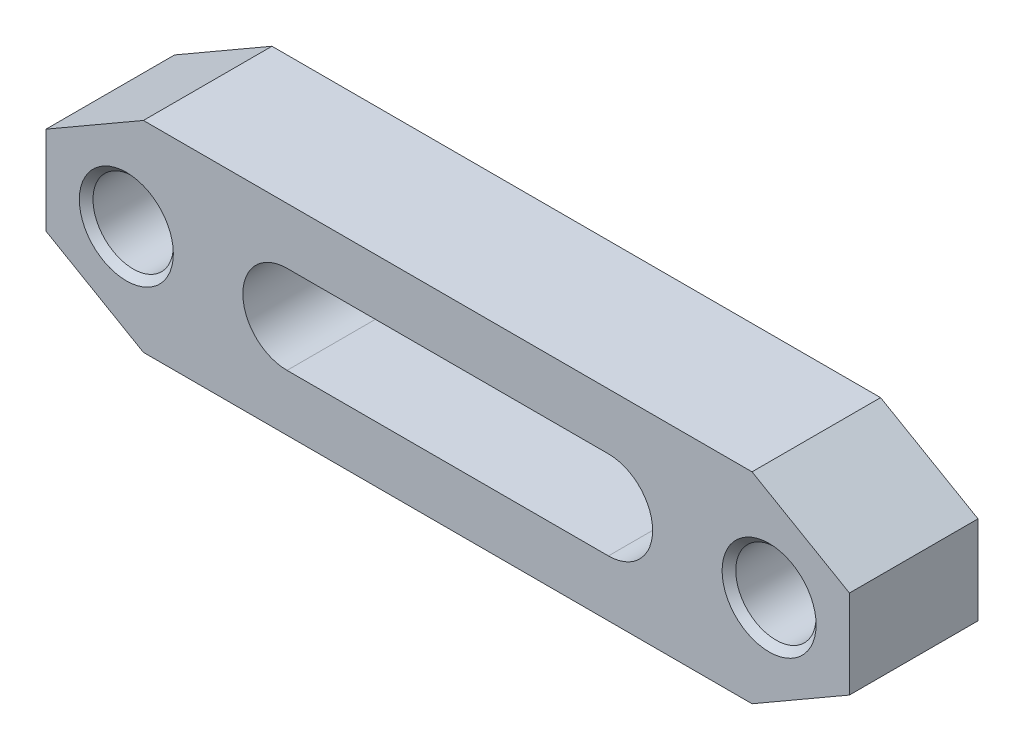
ISO-10303-21;
HEADER;
FILE_DESCRIPTION(('STEP AP214'),'2;1');
FILE_NAME('part.step','',(''),(''),'','','');
FILE_SCHEMA(('AUTOMOTIVE_DESIGN { 1 0 10303 214 1 1 1 1 }'));
ENDSEC;
DATA;
#1=APPLICATION_CONTEXT('core data for automotive mechanical design processes');
#2=APPLICATION_PROTOCOL_DEFINITION('international standard','automotive_design',2000,#1);
#3=PRODUCT_CONTEXT('',#1,'mechanical');
#4=PRODUCT('Part','Part','',(#3));
#5=PRODUCT_RELATED_PRODUCT_CATEGORY('part','',(#4));
#6=PRODUCT_DEFINITION_FORMATION('','',#4);
#7=PRODUCT_DEFINITION_CONTEXT('part definition',#1,'design');
#8=PRODUCT_DEFINITION('design','',#6,#7);
#9=PRODUCT_DEFINITION_SHAPE('','',#8);
#10=(LENGTH_UNIT() NAMED_UNIT(*) SI_UNIT(.MILLI.,.METRE.));
#11=(NAMED_UNIT(*) PLANE_ANGLE_UNIT() SI_UNIT($,.RADIAN.));
#12=(NAMED_UNIT(*) SI_UNIT($,.STERADIAN.) SOLID_ANGLE_UNIT());
#13=UNCERTAINTY_MEASURE_WITH_UNIT(LENGTH_MEASURE(1.E-05),#10,'distance_accuracy_value','');
#14=(GEOMETRIC_REPRESENTATION_CONTEXT(3) GLOBAL_UNCERTAINTY_ASSIGNED_CONTEXT((#13)) GLOBAL_UNIT_ASSIGNED_CONTEXT((#10,
#11,#12)) REPRESENTATION_CONTEXT('',''));
#15=CARTESIAN_POINT('',(0.,0.,0.));
#16=DIRECTION('',(0.,0.,1.));
#17=DIRECTION('',(1.,0.,0.));
#18=AXIS2_PLACEMENT_3D('',#15,#16,#17);
#19=CARTESIAN_POINT('',(50.,-12.5,16.));
#20=DIRECTION('',(0.,0.,1.));
#21=DIRECTION('',(1.,0.,0.));
#22=AXIS2_PLACEMENT_3D('',#19,#20,#21);
#23=PLANE('',#22);
#24=CARTESIAN_POINT('',(40.,0.,16.));
#25=DIRECTION('',(0.,0.,-1.));
#26=DIRECTION('',(-1.,0.,0.));
#27=AXIS2_PLACEMENT_3D('',#24,#25,#26);
#28=CIRCLE('',#27,5.85);
#29=CARTESIAN_POINT('',(34.15,0.,16.));
#30=VERTEX_POINT('',#29);
#31=EDGE_CURVE('E212',#30,#30,#28,.T.);
#32=ORIENTED_EDGE('',*,*,#31,.T.);
#33=EDGE_LOOP('',(#32));
#34=FACE_BOUND('',#33,.T.);
#35=CARTESIAN_POINT('',(-40.,0.,16.));
#36=DIRECTION('',(0.,0.,-1.));
#37=DIRECTION('',(-1.,0.,0.));
#38=AXIS2_PLACEMENT_3D('',#35,#36,#37);
#39=CIRCLE('',#38,5.85);
#40=CARTESIAN_POINT('',(-45.85,0.,16.));
#41=VERTEX_POINT('',#40);
#42=EDGE_CURVE('E133',#41,#41,#39,.T.);
#43=ORIENTED_EDGE('',*,*,#42,.T.);
#44=EDGE_LOOP('',(#43));
#45=FACE_BOUND('',#44,.T.);
#46=DIRECTION('',(1.,0.,0.));
#47=VECTOR('',#46,1.);
#48=CARTESIAN_POINT('',(-37.8756443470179,-12.5,16.));
#49=LINE('',#48,#47);
#50=CARTESIAN_POINT('',(-37.8756443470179,-12.5,16.));
#51=VERTEX_POINT('',#50);
#52=CARTESIAN_POINT('',(37.8756443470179,-12.5,16.));
#53=VERTEX_POINT('',#52);
#54=EDGE_CURVE('E143',#51,#53,#49,.T.);
#55=ORIENTED_EDGE('',*,*,#54,.T.);
#56=DIRECTION('',(0.866025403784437,0.5,0.));
#57=VECTOR('',#56,1.);
#58=CARTESIAN_POINT('',(37.8756443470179,-12.5,16.));
#59=LINE('',#58,#57);
#60=CARTESIAN_POINT('',(50.,-5.5,16.));
#61=VERTEX_POINT('',#60);
#62=EDGE_CURVE('E146',#53,#61,#59,.T.);
#63=ORIENTED_EDGE('',*,*,#62,.T.);
#64=DIRECTION('',(0.,1.,0.));
#65=VECTOR('',#64,1.);
#66=CARTESIAN_POINT('',(50.,-5.5,16.));
#67=LINE('',#66,#65);
#68=CARTESIAN_POINT('',(50.,5.5,16.));
#69=VERTEX_POINT('',#68);
#70=EDGE_CURVE('E149',#61,#69,#67,.T.);
#71=ORIENTED_EDGE('',*,*,#70,.T.);
#72=DIRECTION('',(-0.866025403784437,0.5,0.));
#73=VECTOR('',#72,1.);
#74=CARTESIAN_POINT('',(37.8756443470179,12.5,16.));
#75=LINE('',#74,#73);
#76=CARTESIAN_POINT('',(37.8756443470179,12.5,16.));
#77=VERTEX_POINT('',#76);
#78=EDGE_CURVE('E151',#69,#77,#75,.T.);
#79=ORIENTED_EDGE('',*,*,#78,.T.);
#80=DIRECTION('',(-1.,0.,0.));
#81=VECTOR('',#80,1.);
#82=CARTESIAN_POINT('',(-37.8756443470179,12.5,16.));
#83=LINE('',#82,#81);
#84=CARTESIAN_POINT('',(-37.8756443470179,12.5,16.));
#85=VERTEX_POINT('',#84);
#86=EDGE_CURVE('E153',#77,#85,#83,.T.);
#87=ORIENTED_EDGE('',*,*,#86,.T.);
#88=DIRECTION('',(-0.866025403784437,-0.5,0.));
#89=VECTOR('',#88,1.);
#90=CARTESIAN_POINT('',(-37.8756443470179,12.5,16.));
#91=LINE('',#90,#89);
#92=CARTESIAN_POINT('',(-50.,5.5,16.));
#93=VERTEX_POINT('',#92);
#94=EDGE_CURVE('E155',#85,#93,#91,.T.);
#95=ORIENTED_EDGE('',*,*,#94,.T.);
#96=DIRECTION('',(0.,-1.,0.));
#97=VECTOR('',#96,1.);
#98=CARTESIAN_POINT('',(-50.,-5.5,16.));
#99=LINE('',#98,#97);
#100=CARTESIAN_POINT('',(-50.,-5.5,16.));
#101=VERTEX_POINT('',#100);
#102=EDGE_CURVE('E157',#93,#101,#99,.T.);
#103=ORIENTED_EDGE('',*,*,#102,.T.);
#104=DIRECTION('',(0.866025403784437,-0.5,0.));
#105=VECTOR('',#104,1.);
#106=CARTESIAN_POINT('',(-37.8756443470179,-12.5,16.));
#107=LINE('',#106,#105);
#108=EDGE_CURVE('E159',#101,#51,#107,.T.);
#109=ORIENTED_EDGE('',*,*,#108,.T.);
#110=EDGE_LOOP('',(#55,#63,#71,#79,#87,#95,#103,#109));
#111=FACE_BOUND('',#110,.T.);
#112=DIRECTION('',(-1.,0.,0.));
#113=VECTOR('',#112,1.);
#114=CARTESIAN_POINT('',(20.,5.5,16.));
#115=LINE('',#114,#113);
#116=CARTESIAN_POINT('',(20.,5.5,16.));
#117=VERTEX_POINT('',#116);
#118=CARTESIAN_POINT('',(-20.,5.5,16.));
#119=VERTEX_POINT('',#118);
#120=EDGE_CURVE('E113',#117,#119,#115,.T.);
#121=ORIENTED_EDGE('',*,*,#120,.F.);
#122=CARTESIAN_POINT('',(20.,0.,16.));
#123=DIRECTION('',(0.,0.,1.));
#124=DIRECTION('',(1.,0.,0.));
#125=AXIS2_PLACEMENT_3D('',#122,#123,#124);
#126=CIRCLE('',#125,5.5);
#127=CARTESIAN_POINT('',(20.,-5.5,16.));
#128=VERTEX_POINT('',#127);
#129=EDGE_CURVE('E105',#128,#117,#126,.T.);
#130=ORIENTED_EDGE('',*,*,#129,.F.);
#131=DIRECTION('',(1.,0.,0.));
#132=VECTOR('',#131,1.);
#133=CARTESIAN_POINT('',(20.,-5.5,16.));
#134=LINE('',#133,#132);
#135=CARTESIAN_POINT('',(-20.,-5.5,16.));
#136=VERTEX_POINT('',#135);
#137=EDGE_CURVE('E127',#136,#128,#134,.T.);
#138=ORIENTED_EDGE('',*,*,#137,.F.);
#139=CARTESIAN_POINT('',(-20.,0.,16.));
#140=DIRECTION('',(0.,0.,1.));
#141=DIRECTION('',(1.,0.,0.));
#142=AXIS2_PLACEMENT_3D('',#139,#140,#141);
#143=CIRCLE('',#142,5.5);
#144=EDGE_CURVE('E125',#119,#136,#143,.T.);
#145=ORIENTED_EDGE('',*,*,#144,.F.);
#146=EDGE_LOOP('',(#121,#130,#138,#145));
#147=FACE_BOUND('',#146,.T.);
#148=ADVANCED_FACE('F14',(#34,#45,#111,#147),#23,.T.);
#149=CARTESIAN_POINT('',(50.,-12.5,0.));
#150=DIRECTION('',(0.,0.,1.));
#151=DIRECTION('',(1.,0.,0.));
#152=AXIS2_PLACEMENT_3D('',#149,#150,#151);
#153=PLANE('',#152);
#154=CARTESIAN_POINT('',(40.,0.,0.));
#155=DIRECTION('',(0.,0.,-1.));
#156=DIRECTION('',(-1.,0.,0.));
#157=AXIS2_PLACEMENT_3D('',#154,#155,#156);
#158=CIRCLE('',#157,5.85);
#159=CARTESIAN_POINT('',(34.15,0.,0.));
#160=VERTEX_POINT('',#159);
#161=EDGE_CURVE('E202',#160,#160,#158,.T.);
#162=ORIENTED_EDGE('',*,*,#161,.F.);
#163=EDGE_LOOP('',(#162));
#164=FACE_BOUND('',#163,.T.);
#165=CARTESIAN_POINT('',(-40.,0.,0.));
#166=DIRECTION('',(0.,0.,-1.));
#167=DIRECTION('',(-1.,0.,0.));
#168=AXIS2_PLACEMENT_3D('',#165,#166,#167);
#169=CIRCLE('',#168,5.85);
#170=CARTESIAN_POINT('',(-45.85,0.,0.));
#171=VERTEX_POINT('',#170);
#172=EDGE_CURVE('E215',#171,#171,#169,.T.);
#173=ORIENTED_EDGE('',*,*,#172,.F.);
#174=EDGE_LOOP('',(#173));
#175=FACE_BOUND('',#174,.T.);
#176=DIRECTION('',(1.,0.,0.));
#177=VECTOR('',#176,1.);
#178=CARTESIAN_POINT('',(-37.8756443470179,-12.5,0.));
#179=LINE('',#178,#177);
#180=CARTESIAN_POINT('',(-37.8756443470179,-12.5,0.));
#181=VERTEX_POINT('',#180);
#182=CARTESIAN_POINT('',(37.8756443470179,-12.5,0.));
#183=VERTEX_POINT('',#182);
#184=EDGE_CURVE('E121',#181,#183,#179,.T.);
#185=ORIENTED_EDGE('',*,*,#184,.F.);
#186=DIRECTION('',(0.866025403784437,-0.5,0.));
#187=VECTOR('',#186,1.);
#188=CARTESIAN_POINT('',(-37.8756443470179,-12.5,0.));
#189=LINE('',#188,#187);
#190=CARTESIAN_POINT('',(-50.,-5.5,0.));
#191=VERTEX_POINT('',#190);
#192=EDGE_CURVE('E147',#191,#181,#189,.T.);
#193=ORIENTED_EDGE('',*,*,#192,.F.);
#194=DIRECTION('',(0.,-1.,0.));
#195=VECTOR('',#194,1.);
#196=CARTESIAN_POINT('',(-50.,-5.5,0.));
#197=LINE('',#196,#195);
#198=CARTESIAN_POINT('',(-50.,5.5,0.));
#199=VERTEX_POINT('',#198);
#200=EDGE_CURVE('E174',#199,#191,#197,.T.);
#201=ORIENTED_EDGE('',*,*,#200,.F.);
#202=DIRECTION('',(-0.866025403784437,-0.5,0.));
#203=VECTOR('',#202,1.);
#204=CARTESIAN_POINT('',(-37.8756443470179,12.5,0.));
#205=LINE('',#204,#203);
#206=CARTESIAN_POINT('',(-37.8756443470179,12.5,0.));
#207=VERTEX_POINT('',#206);
#208=EDGE_CURVE('E172',#207,#199,#205,.T.);
#209=ORIENTED_EDGE('',*,*,#208,.F.);
#210=DIRECTION('',(-1.,0.,0.));
#211=VECTOR('',#210,1.);
#212=CARTESIAN_POINT('',(-37.8756443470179,12.5,0.));
#213=LINE('',#212,#211);
#214=CARTESIAN_POINT('',(37.8756443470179,12.5,0.));
#215=VERTEX_POINT('',#214);
#216=EDGE_CURVE('E170',#215,#207,#213,.T.);
#217=ORIENTED_EDGE('',*,*,#216,.F.);
#218=DIRECTION('',(-0.866025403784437,0.5,0.));
#219=VECTOR('',#218,1.);
#220=CARTESIAN_POINT('',(37.8756443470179,12.5,0.));
#221=LINE('',#220,#219);
#222=CARTESIAN_POINT('',(50.,5.5,0.));
#223=VERTEX_POINT('',#222);
#224=EDGE_CURVE('E168',#223,#215,#221,.T.);
#225=ORIENTED_EDGE('',*,*,#224,.F.);
#226=DIRECTION('',(0.,1.,0.));
#227=VECTOR('',#226,1.);
#228=CARTESIAN_POINT('',(50.,-5.5,0.));
#229=LINE('',#228,#227);
#230=CARTESIAN_POINT('',(50.,-5.5,0.));
#231=VERTEX_POINT('',#230);
#232=EDGE_CURVE('E166',#231,#223,#229,.T.);
#233=ORIENTED_EDGE('',*,*,#232,.F.);
#234=DIRECTION('',(0.866025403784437,0.5,0.));
#235=VECTOR('',#234,1.);
#236=CARTESIAN_POINT('',(37.8756443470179,-12.5,0.));
#237=LINE('',#236,#235);
#238=EDGE_CURVE('E164',#183,#231,#237,.T.);
#239=ORIENTED_EDGE('',*,*,#238,.F.);
#240=EDGE_LOOP('',(#185,#193,#201,#209,#217,#225,#233,#239));
#241=FACE_BOUND('',#240,.T.);
#242=CARTESIAN_POINT('',(20.,0.,0.));
#243=DIRECTION('',(0.,0.,1.));
#244=DIRECTION('',(1.,0.,0.));
#245=AXIS2_PLACEMENT_3D('',#242,#243,#244);
#246=CIRCLE('',#245,5.5);
#247=CARTESIAN_POINT('',(20.,-5.5,0.));
#248=VERTEX_POINT('',#247);
#249=CARTESIAN_POINT('',(20.,5.5,0.));
#250=VERTEX_POINT('',#249);
#251=EDGE_CURVE('E39',#248,#250,#246,.T.);
#252=ORIENTED_EDGE('',*,*,#251,.T.);
#253=DIRECTION('',(-1.,0.,0.));
#254=VECTOR('',#253,1.);
#255=CARTESIAN_POINT('',(20.,5.5,0.));
#256=LINE('',#255,#254);
#257=CARTESIAN_POINT('',(-20.,5.5,0.));
#258=VERTEX_POINT('',#257);
#259=EDGE_CURVE('E120',#250,#258,#256,.T.);
#260=ORIENTED_EDGE('',*,*,#259,.T.);
#261=CARTESIAN_POINT('',(-20.,0.,0.));
#262=DIRECTION('',(0.,0.,1.));
#263=DIRECTION('',(1.,0.,0.));
#264=AXIS2_PLACEMENT_3D('',#261,#262,#263);
#265=CIRCLE('',#264,5.5);
#266=CARTESIAN_POINT('',(-20.,-5.5,0.));
#267=VERTEX_POINT('',#266);
#268=EDGE_CURVE('E135',#258,#267,#265,.T.);
#269=ORIENTED_EDGE('',*,*,#268,.T.);
#270=DIRECTION('',(1.,0.,0.));
#271=VECTOR('',#270,1.);
#272=CARTESIAN_POINT('',(20.,-5.5,0.));
#273=LINE('',#272,#271);
#274=EDGE_CURVE('E114',#267,#248,#273,.T.);
#275=ORIENTED_EDGE('',*,*,#274,.T.);
#276=EDGE_LOOP('',(#252,#260,#269,#275));
#277=FACE_BOUND('',#276,.T.);
#278=ADVANCED_FACE('F238',(#164,#175,#241,#277),#153,.F.);
#279=CARTESIAN_POINT('',(-37.8756443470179,-12.5,16.));
#280=DIRECTION('',(0.,1.,0.));
#281=DIRECTION('',(-1.,0.,0.));
#282=AXIS2_PLACEMENT_3D('',#279,#280,#281);
#283=PLANE('',#282);
#284=ORIENTED_EDGE('',*,*,#184,.T.);
#285=DIRECTION('',(0.,0.,-1.));
#286=VECTOR('',#285,1.);
#287=CARTESIAN_POINT('',(37.8756443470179,-12.5,16.));
#288=LINE('',#287,#286);
#289=EDGE_CURVE('E9',#53,#183,#288,.T.);
#290=ORIENTED_EDGE('',*,*,#289,.F.);
#291=ORIENTED_EDGE('',*,*,#54,.F.);
#292=DIRECTION('',(0.,0.,-1.));
#293=VECTOR('',#292,1.);
#294=CARTESIAN_POINT('',(-37.8756443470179,-12.5,16.));
#295=LINE('',#294,#293);
#296=EDGE_CURVE('E161',#51,#181,#295,.T.);
#297=ORIENTED_EDGE('',*,*,#296,.T.);
#298=EDGE_LOOP('',(#284,#290,#291,#297));
#299=FACE_BOUND('',#298,.T.);
#300=ADVANCED_FACE('F16',(#299),#283,.F.);
#301=CARTESIAN_POINT('',(37.8756443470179,-12.5,16.));
#302=DIRECTION('',(-0.5,0.866025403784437,0.));
#303=DIRECTION('',(-0.866025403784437,-0.5,0.));
#304=AXIS2_PLACEMENT_3D('',#301,#302,#303);
#305=PLANE('',#304);
#306=ORIENTED_EDGE('',*,*,#238,.T.);
#307=DIRECTION('',(0.,0.,-1.));
#308=VECTOR('',#307,1.);
#309=CARTESIAN_POINT('',(50.,-5.5,16.));
#310=LINE('',#309,#308);
#311=EDGE_CURVE('E23',#61,#231,#310,.T.);
#312=ORIENTED_EDGE('',*,*,#311,.F.);
#313=ORIENTED_EDGE('',*,*,#62,.F.);
#314=ORIENTED_EDGE('',*,*,#289,.T.);
#315=EDGE_LOOP('',(#306,#312,#313,#314));
#316=FACE_BOUND('',#315,.T.);
#317=ADVANCED_FACE('F271',(#316),#305,.F.);
#318=CARTESIAN_POINT('',(50.,-5.5,16.));
#319=DIRECTION('',(-1.,0.,0.));
#320=DIRECTION('',(0.,0.,1.));
#321=AXIS2_PLACEMENT_3D('',#318,#319,#320);
#322=PLANE('',#321);
#323=ORIENTED_EDGE('',*,*,#232,.T.);
#324=DIRECTION('',(0.,0.,-1.));
#325=VECTOR('',#324,1.);
#326=CARTESIAN_POINT('',(50.,5.5,16.));
#327=LINE('',#326,#325);
#328=EDGE_CURVE('E191',#69,#223,#327,.T.);
#329=ORIENTED_EDGE('',*,*,#328,.F.);
#330=ORIENTED_EDGE('',*,*,#70,.F.);
#331=ORIENTED_EDGE('',*,*,#311,.T.);
#332=EDGE_LOOP('',(#323,#329,#330,#331));
#333=FACE_BOUND('',#332,.T.);
#334=ADVANCED_FACE('F268',(#333),#322,.F.);
#335=CARTESIAN_POINT('',(37.8756443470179,12.5,16.));
#336=DIRECTION('',(-0.5,-0.866025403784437,0.));
#337=DIRECTION('',(0.866025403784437,-0.5,0.));
#338=AXIS2_PLACEMENT_3D('',#335,#336,#337);
#339=PLANE('',#338);
#340=ORIENTED_EDGE('',*,*,#224,.T.);
#341=DIRECTION('',(0.,0.,-1.));
#342=VECTOR('',#341,1.);
#343=CARTESIAN_POINT('',(37.8756443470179,12.5,16.));
#344=LINE('',#343,#342);
#345=EDGE_CURVE('E188',#77,#215,#344,.T.);
#346=ORIENTED_EDGE('',*,*,#345,.F.);
#347=ORIENTED_EDGE('',*,*,#78,.F.);
#348=ORIENTED_EDGE('',*,*,#328,.T.);
#349=EDGE_LOOP('',(#340,#346,#347,#348));
#350=FACE_BOUND('',#349,.T.);
#351=ADVANCED_FACE('F264',(#350),#339,.F.);
#352=CARTESIAN_POINT('',(-37.8756443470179,12.5,16.));
#353=DIRECTION('',(0.,-1.,0.));
#354=DIRECTION('',(0.,0.,-1.));
#355=AXIS2_PLACEMENT_3D('',#352,#353,#354);
#356=PLANE('',#355);
#357=ORIENTED_EDGE('',*,*,#216,.T.);
#358=DIRECTION('',(0.,0.,-1.));
#359=VECTOR('',#358,1.);
#360=CARTESIAN_POINT('',(-37.8756443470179,12.5,16.));
#361=LINE('',#360,#359);
#362=EDGE_CURVE('E185',#85,#207,#361,.T.);
#363=ORIENTED_EDGE('',*,*,#362,.F.);
#364=ORIENTED_EDGE('',*,*,#86,.F.);
#365=ORIENTED_EDGE('',*,*,#345,.T.);
#366=EDGE_LOOP('',(#357,#363,#364,#365));
#367=FACE_BOUND('',#366,.T.);
#368=ADVANCED_FACE('F260',(#367),#356,.F.);
#369=CARTESIAN_POINT('',(-37.8756443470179,12.5,16.));
#370=DIRECTION('',(0.5,-0.866025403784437,0.));
#371=DIRECTION('',(0.866025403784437,0.5,0.));
#372=AXIS2_PLACEMENT_3D('',#369,#370,#371);
#373=PLANE('',#372);
#374=ORIENTED_EDGE('',*,*,#208,.T.);
#375=DIRECTION('',(0.,0.,-1.));
#376=VECTOR('',#375,1.);
#377=CARTESIAN_POINT('',(-50.,5.5,16.));
#378=LINE('',#377,#376);
#379=EDGE_CURVE('E182',#93,#199,#378,.T.);
#380=ORIENTED_EDGE('',*,*,#379,.F.);
#381=ORIENTED_EDGE('',*,*,#94,.F.);
#382=ORIENTED_EDGE('',*,*,#362,.T.);
#383=EDGE_LOOP('',(#374,#380,#381,#382));
#384=FACE_BOUND('',#383,.T.);
#385=ADVANCED_FACE('F256',(#384),#373,.F.);
#386=CARTESIAN_POINT('',(-50.,-5.5,16.));
#387=DIRECTION('',(1.,0.,0.));
#388=DIRECTION('',(0.,0.,-1.));
#389=AXIS2_PLACEMENT_3D('',#386,#387,#388);
#390=PLANE('',#389);
#391=ORIENTED_EDGE('',*,*,#200,.T.);
#392=DIRECTION('',(0.,0.,-1.));
#393=VECTOR('',#392,1.);
#394=CARTESIAN_POINT('',(-50.,-5.5,16.));
#395=LINE('',#394,#393);
#396=EDGE_CURVE('E179',#101,#191,#395,.T.);
#397=ORIENTED_EDGE('',*,*,#396,.F.);
#398=ORIENTED_EDGE('',*,*,#102,.F.);
#399=ORIENTED_EDGE('',*,*,#379,.T.);
#400=EDGE_LOOP('',(#391,#397,#398,#399));
#401=FACE_BOUND('',#400,.T.);
#402=ADVANCED_FACE('F252',(#401),#390,.F.);
#403=CARTESIAN_POINT('',(-37.8756443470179,-12.5,16.));
#404=DIRECTION('',(0.5,0.866025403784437,0.));
#405=DIRECTION('',(-0.866025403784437,0.5,0.));
#406=AXIS2_PLACEMENT_3D('',#403,#404,#405);
#407=PLANE('',#406);
#408=ORIENTED_EDGE('',*,*,#192,.T.);
#409=ORIENTED_EDGE('',*,*,#296,.F.);
#410=ORIENTED_EDGE('',*,*,#108,.F.);
#411=ORIENTED_EDGE('',*,*,#396,.T.);
#412=EDGE_LOOP('',(#408,#409,#410,#411));
#413=FACE_BOUND('',#412,.T.);
#414=ADVANCED_FACE('F249',(#413),#407,.F.);
#415=CARTESIAN_POINT('',(20.,0.,16.));
#416=DIRECTION('',(0.,0.,-1.));
#417=DIRECTION('',(-1.,0.,0.));
#418=AXIS2_PLACEMENT_3D('',#415,#416,#417);
#419=CYLINDRICAL_SURFACE('',#418,5.5);
#420=ORIENTED_EDGE('',*,*,#251,.F.);
#421=DIRECTION('',(0.,0.,-1.));
#422=VECTOR('',#421,1.);
#423=CARTESIAN_POINT('',(20.,-5.5,16.));
#424=LINE('',#423,#422);
#425=EDGE_CURVE('E109',#128,#248,#424,.T.);
#426=ORIENTED_EDGE('',*,*,#425,.F.);
#427=ORIENTED_EDGE('',*,*,#129,.T.);
#428=DIRECTION('',(0.,0.,-1.));
#429=VECTOR('',#428,1.);
#430=CARTESIAN_POINT('',(20.,5.5,16.));
#431=LINE('',#430,#429);
#432=EDGE_CURVE('E108',#117,#250,#431,.T.);
#433=ORIENTED_EDGE('',*,*,#432,.T.);
#434=EDGE_LOOP('',(#420,#426,#427,#433));
#435=FACE_BOUND('',#434,.T.);
#436=ADVANCED_FACE('F107',(#435),#419,.F.);
#437=CARTESIAN_POINT('',(20.,5.5,16.));
#438=DIRECTION('',(0.,-1.,0.));
#439=DIRECTION('',(1.,0.,0.));
#440=AXIS2_PLACEMENT_3D('',#437,#438,#439);
#441=PLANE('',#440);
#442=ORIENTED_EDGE('',*,*,#259,.F.);
#443=ORIENTED_EDGE('',*,*,#432,.F.);
#444=ORIENTED_EDGE('',*,*,#120,.T.);
#445=DIRECTION('',(0.,0.,-1.));
#446=VECTOR('',#445,1.);
#447=CARTESIAN_POINT('',(-20.,5.5,16.));
#448=LINE('',#447,#446);
#449=EDGE_CURVE('E122',#119,#258,#448,.T.);
#450=ORIENTED_EDGE('',*,*,#449,.T.);
#451=EDGE_LOOP('',(#442,#443,#444,#450));
#452=FACE_BOUND('',#451,.T.);
#453=ADVANCED_FACE('F117',(#452),#441,.T.);
#454=CARTESIAN_POINT('',(-20.,0.,16.));
#455=DIRECTION('',(0.,0.,-1.));
#456=DIRECTION('',(-1.,0.,0.));
#457=AXIS2_PLACEMENT_3D('',#454,#455,#456);
#458=CYLINDRICAL_SURFACE('',#457,5.5);
#459=ORIENTED_EDGE('',*,*,#268,.F.);
#460=ORIENTED_EDGE('',*,*,#449,.F.);
#461=ORIENTED_EDGE('',*,*,#144,.T.);
#462=DIRECTION('',(0.,0.,-1.));
#463=VECTOR('',#462,1.);
#464=CARTESIAN_POINT('',(-20.,-5.5,16.));
#465=LINE('',#464,#463);
#466=EDGE_CURVE('E31',#136,#267,#465,.T.);
#467=ORIENTED_EDGE('',*,*,#466,.T.);
#468=EDGE_LOOP('',(#459,#460,#461,#467));
#469=FACE_BOUND('',#468,.T.);
#470=ADVANCED_FACE('F235',(#469),#458,.F.);
#471=CARTESIAN_POINT('',(20.,-5.5,16.));
#472=DIRECTION('',(0.,1.,0.));
#473=DIRECTION('',(-1.,0.,0.));
#474=AXIS2_PLACEMENT_3D('',#471,#472,#473);
#475=PLANE('',#474);
#476=ORIENTED_EDGE('',*,*,#274,.F.);
#477=ORIENTED_EDGE('',*,*,#466,.F.);
#478=ORIENTED_EDGE('',*,*,#137,.T.);
#479=ORIENTED_EDGE('',*,*,#425,.T.);
#480=EDGE_LOOP('',(#476,#477,#478,#479));
#481=FACE_BOUND('',#480,.T.);
#482=ADVANCED_FACE('F225',(#481),#475,.T.);
#483=CARTESIAN_POINT('',(-40.,0.,14.5));
#484=DIRECTION('',(0.,0.,1.));
#485=DIRECTION('',(1.,0.,0.));
#486=AXIS2_PLACEMENT_3D('',#483,#484,#485);
#487=CONICAL_SURFACE('',#486,4.35,0.78539816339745);
#488=CARTESIAN_POINT('',(-40.,0.,15.15));
#489=DIRECTION('',(0.,0.,1.));
#490=DIRECTION('',(1.,0.,0.));
#491=AXIS2_PLACEMENT_3D('',#488,#489,#490);
#492=CIRCLE('',#491,5.);
#493=CARTESIAN_POINT('',(-35.,0.,15.15));
#494=VERTEX_POINT('',#493);
#495=EDGE_CURVE('E197',#494,#494,#492,.F.);
#496=ORIENTED_EDGE('',*,*,#495,.T.);
#497=EDGE_LOOP('',(#496));
#498=FACE_BOUND('',#497,.T.);
#499=ORIENTED_EDGE('',*,*,#42,.F.);
#500=EDGE_LOOP('',(#499));
#501=FACE_BOUND('',#500,.T.);
#502=ADVANCED_FACE('F222',(#498,#501),#487,.F.);
#503=CARTESIAN_POINT('',(-40.,0.,0.));
#504=DIRECTION('',(0.,0.,-1.));
#505=DIRECTION('',(-1.,0.,0.));
#506=AXIS2_PLACEMENT_3D('',#503,#504,#505);
#507=CONICAL_SURFACE('',#506,5.85,0.785398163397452);
#508=CARTESIAN_POINT('',(-40.,0.,0.85));
#509=DIRECTION('',(0.,0.,-1.));
#510=DIRECTION('',(-1.,0.,0.));
#511=AXIS2_PLACEMENT_3D('',#508,#509,#510);
#512=CIRCLE('',#511,5.);
#513=CARTESIAN_POINT('',(-45.,0.,0.85));
#514=VERTEX_POINT('',#513);
#515=EDGE_CURVE('E195',#514,#514,#512,.F.);
#516=ORIENTED_EDGE('',*,*,#515,.T.);
#517=EDGE_LOOP('',(#516));
#518=FACE_BOUND('',#517,.T.);
#519=ORIENTED_EDGE('',*,*,#172,.T.);
#520=EDGE_LOOP('',(#519));
#521=FACE_BOUND('',#520,.T.);
#522=ADVANCED_FACE('F224',(#518,#521),#507,.F.);
#523=CARTESIAN_POINT('',(40.,0.,14.5));
#524=DIRECTION('',(0.,0.,1.));
#525=DIRECTION('',(1.,0.,0.));
#526=AXIS2_PLACEMENT_3D('',#523,#524,#525);
#527=CONICAL_SURFACE('',#526,4.35,0.78539816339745);
#528=CARTESIAN_POINT('',(40.,0.,15.15));
#529=DIRECTION('',(0.,0.,1.));
#530=DIRECTION('',(1.,0.,0.));
#531=AXIS2_PLACEMENT_3D('',#528,#529,#530);
#532=CIRCLE('',#531,5.);
#533=CARTESIAN_POINT('',(45.,0.,15.15));
#534=VERTEX_POINT('',#533);
#535=EDGE_CURVE('E198',#534,#534,#532,.F.);
#536=ORIENTED_EDGE('',*,*,#535,.T.);
#537=EDGE_LOOP('',(#536));
#538=FACE_BOUND('',#537,.T.);
#539=ORIENTED_EDGE('',*,*,#31,.F.);
#540=EDGE_LOOP('',(#539));
#541=FACE_BOUND('',#540,.T.);
#542=ADVANCED_FACE('F233',(#538,#541),#527,.F.);
#543=CARTESIAN_POINT('',(40.,0.,0.));
#544=DIRECTION('',(0.,0.,-1.));
#545=DIRECTION('',(-1.,0.,0.));
#546=AXIS2_PLACEMENT_3D('',#543,#544,#545);
#547=CONICAL_SURFACE('',#546,5.85,0.785398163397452);
#548=CARTESIAN_POINT('',(40.,0.,0.85));
#549=DIRECTION('',(0.,0.,-1.));
#550=DIRECTION('',(-1.,0.,0.));
#551=AXIS2_PLACEMENT_3D('',#548,#549,#550);
#552=CIRCLE('',#551,5.);
#553=CARTESIAN_POINT('',(35.,0.,0.85));
#554=VERTEX_POINT('',#553);
#555=EDGE_CURVE('E18',#554,#554,#552,.F.);
#556=ORIENTED_EDGE('',*,*,#555,.T.);
#557=EDGE_LOOP('',(#556));
#558=FACE_BOUND('',#557,.T.);
#559=ORIENTED_EDGE('',*,*,#161,.T.);
#560=EDGE_LOOP('',(#559));
#561=FACE_BOUND('',#560,.T.);
#562=ADVANCED_FACE('F398',(#558,#561),#547,.F.);
#563=CARTESIAN_POINT('',(-40.,0.,0.));
#564=DIRECTION('',(0.,0.,1.));
#565=DIRECTION('',(1.,0.,0.));
#566=AXIS2_PLACEMENT_3D('',#563,#564,#565);
#567=CYLINDRICAL_SURFACE('',#566,5.);
#568=ORIENTED_EDGE('',*,*,#515,.F.);
#569=EDGE_LOOP('',(#568));
#570=FACE_BOUND('',#569,.T.);
#571=ORIENTED_EDGE('',*,*,#495,.F.);
#572=EDGE_LOOP('',(#571));
#573=FACE_BOUND('',#572,.T.);
#574=ADVANCED_FACE('F407',(#570,#573),#567,.F.);
#575=CARTESIAN_POINT('',(40.,0.,0.));
#576=DIRECTION('',(0.,0.,1.));
#577=DIRECTION('',(1.,0.,0.));
#578=AXIS2_PLACEMENT_3D('',#575,#576,#577);
#579=CYLINDRICAL_SURFACE('',#578,5.);
#580=ORIENTED_EDGE('',*,*,#555,.F.);
#581=EDGE_LOOP('',(#580));
#582=FACE_BOUND('',#581,.T.);
#583=ORIENTED_EDGE('',*,*,#535,.F.);
#584=EDGE_LOOP('',(#583));
#585=FACE_BOUND('',#584,.T.);
#586=ADVANCED_FACE('F417',(#582,#585),#579,.F.);
#587=CLOSED_SHELL('',(#148,#278,#300,#317,#334,#351,#368,#385,#402,#414,#436,#453,#470,#482,
#502,#522,#542,#562,#574,#586));
#588=MANIFOLD_SOLID_BREP('B1',#587);
#589=ADVANCED_BREP_SHAPE_REPRESENTATION('',(#18,#588),#14);
#590=SHAPE_DEFINITION_REPRESENTATION(#9,#589);
ENDSEC;
END-ISO-10303-21;
